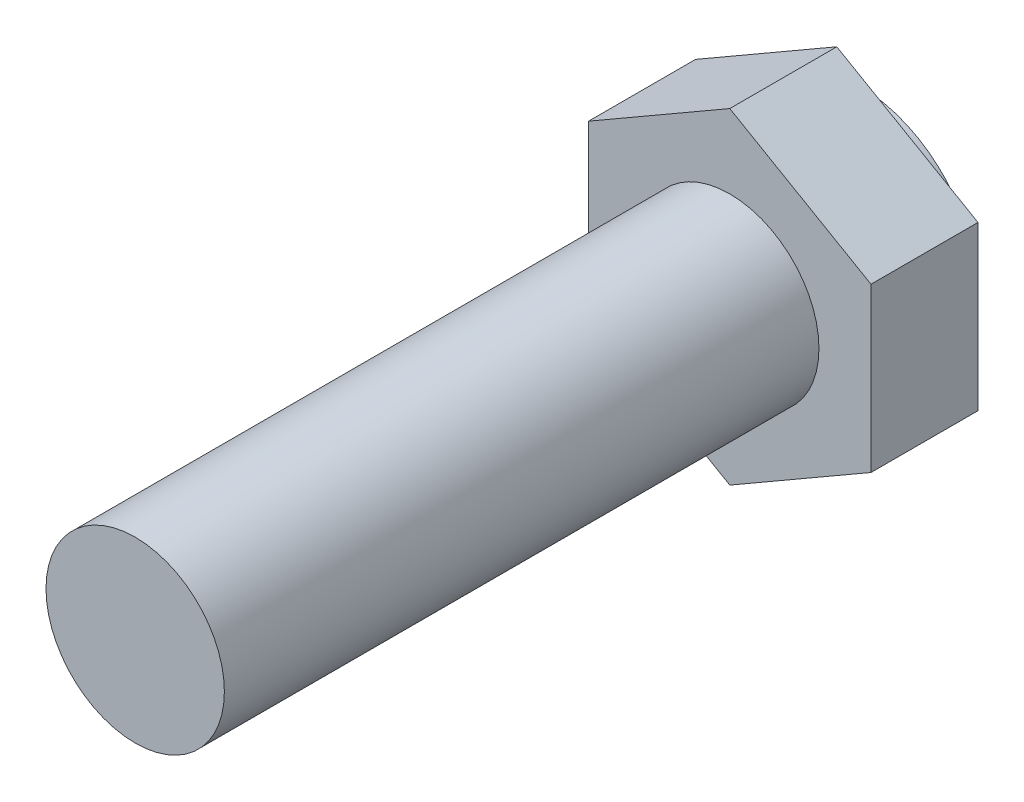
ISO-10303-21;
HEADER;
FILE_DESCRIPTION(('STEP AP214'),'2;1');
FILE_NAME('part.step','',(''),(''),'','','');
FILE_SCHEMA(('AUTOMOTIVE_DESIGN { 1 0 10303 214 1 1 1 1 }'));
ENDSEC;
DATA;
#1=APPLICATION_CONTEXT('core data for automotive mechanical design processes');
#2=APPLICATION_PROTOCOL_DEFINITION('international standard','automotive_design',2000,#1);
#3=PRODUCT_CONTEXT('',#1,'mechanical');
#4=PRODUCT('Part','Part','',(#3));
#5=PRODUCT_RELATED_PRODUCT_CATEGORY('part','',(#4));
#6=PRODUCT_DEFINITION_FORMATION('','',#4);
#7=PRODUCT_DEFINITION_CONTEXT('part definition',#1,'design');
#8=PRODUCT_DEFINITION('design','',#6,#7);
#9=PRODUCT_DEFINITION_SHAPE('','',#8);
#10=(LENGTH_UNIT() NAMED_UNIT(*) SI_UNIT(.MILLI.,.METRE.));
#11=(NAMED_UNIT(*) PLANE_ANGLE_UNIT() SI_UNIT($,.RADIAN.));
#12=(NAMED_UNIT(*) SI_UNIT($,.STERADIAN.) SOLID_ANGLE_UNIT());
#13=UNCERTAINTY_MEASURE_WITH_UNIT(LENGTH_MEASURE(1.E-05),#10,'distance_accuracy_value','');
#14=(GEOMETRIC_REPRESENTATION_CONTEXT(3) GLOBAL_UNCERTAINTY_ASSIGNED_CONTEXT((#13)) GLOBAL_UNIT_ASSIGNED_CONTEXT((#10,
#11,#12)) REPRESENTATION_CONTEXT('',''));
#15=CARTESIAN_POINT('',(0.,0.,0.));
#16=DIRECTION('',(0.,0.,1.));
#17=DIRECTION('',(1.,0.,0.));
#18=AXIS2_PLACEMENT_3D('',#15,#16,#17);
#19=CARTESIAN_POINT('',(0.,0.,48.7));
#20=DIRECTION('',(0.,0.,-1.));
#21=DIRECTION('',(-1.,0.,0.));
#22=AXIS2_PLACEMENT_3D('',#19,#20,#21);
#23=PLANE('',#22);
#24=CARTESIAN_POINT('',(0.,0.,48.7));
#25=DIRECTION('',(0.,0.,-1.));
#26=DIRECTION('',(-1.,0.,0.));
#27=AXIS2_PLACEMENT_3D('',#24,#25,#26);
#28=CIRCLE('',#27,6.);
#29=CARTESIAN_POINT('',(-6.,0.,48.7));
#30=VERTEX_POINT('',#29);
#31=EDGE_CURVE('E21',#30,#30,#28,.T.);
#32=ORIENTED_EDGE('',*,*,#31,.F.);
#33=EDGE_LOOP('',(#32));
#34=FACE_BOUND('',#33,.T.);
#35=ADVANCED_FACE('F14',(#34),#23,.F.);
#36=CARTESIAN_POINT('',(0.,0.,-21.3));
#37=DIRECTION('',(0.,0.,-1.));
#38=DIRECTION('',(-1.,0.,0.));
#39=AXIS2_PLACEMENT_3D('',#36,#37,#38);
#40=CYLINDRICAL_SURFACE('',#39,6.);
#41=CARTESIAN_POINT('',(0.,0.,8.7));
#42=DIRECTION('',(0.,0.,-1.));
#43=DIRECTION('',(-1.,0.,0.));
#44=AXIS2_PLACEMENT_3D('',#41,#42,#43);
#45=CIRCLE('',#44,6.);
#46=CARTESIAN_POINT('',(-6.,0.,8.7));
#47=VERTEX_POINT('',#46);
#48=EDGE_CURVE('E109',#47,#47,#45,.T.);
#49=ORIENTED_EDGE('',*,*,#48,.F.);
#50=EDGE_LOOP('',(#49));
#51=FACE_BOUND('',#50,.T.);
#52=ORIENTED_EDGE('',*,*,#31,.T.);
#53=EDGE_LOOP('',(#52));
#54=FACE_BOUND('',#53,.T.);
#55=ADVANCED_FACE('F153',(#51,#54),#40,.T.);
#56=CARTESIAN_POINT('',(-6.,0.,8.7));
#57=DIRECTION('',(0.,0.,-1.));
#58=DIRECTION('',(-1.,0.,0.));
#59=AXIS2_PLACEMENT_3D('',#56,#57,#58);
#60=PLANE('',#59);
#61=DIRECTION('',(0.866025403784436,-0.5,0.));
#62=VECTOR('',#61,1.);
#63=CARTESIAN_POINT('',(0.250000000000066,10.8253175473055,8.7));
#64=LINE('',#63,#62);
#65=CARTESIAN_POINT('',(0.,10.9696551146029,8.7));
#66=VERTEX_POINT('',#65);
#67=CARTESIAN_POINT('',(9.5,5.48482755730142,8.7));
#68=VERTEX_POINT('',#67);
#69=EDGE_CURVE('E80',#66,#68,#64,.T.);
#70=ORIENTED_EDGE('',*,*,#69,.F.);
#71=DIRECTION('',(-0.866025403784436,-0.5,0.));
#72=VECTOR('',#71,1.);
#73=CARTESIAN_POINT('',(-9.25,5.62916512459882,8.7));
#74=LINE('',#73,#72);
#75=CARTESIAN_POINT('',(-9.5,5.48482755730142,8.7));
#76=VERTEX_POINT('',#75);
#77=EDGE_CURVE('E106',#66,#76,#74,.T.);
#78=ORIENTED_EDGE('',*,*,#77,.T.);
#79=DIRECTION('',(0.,-1.,0.));
#80=VECTOR('',#79,1.);
#81=CARTESIAN_POINT('',(-9.5,0.,8.7));
#82=LINE('',#81,#80);
#83=CARTESIAN_POINT('',(-9.5,-5.48482755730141,8.7));
#84=VERTEX_POINT('',#83);
#85=EDGE_CURVE('E103',#76,#84,#82,.T.);
#86=ORIENTED_EDGE('',*,*,#85,.T.);
#87=DIRECTION('',(-0.866025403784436,0.5,0.));
#88=VECTOR('',#87,1.);
#89=CARTESIAN_POINT('',(-9.25,-5.62916512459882,8.7));
#90=LINE('',#89,#88);
#91=CARTESIAN_POINT('',(0.,-10.9696551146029,8.7));
#92=VERTEX_POINT('',#91);
#93=EDGE_CURVE('E101',#92,#84,#90,.T.);
#94=ORIENTED_EDGE('',*,*,#93,.F.);
#95=DIRECTION('',(0.866025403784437,0.5,0.));
#96=VECTOR('',#95,1.);
#97=CARTESIAN_POINT('',(0.250000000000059,-10.8253175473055,8.7));
#98=LINE('',#97,#96);
#99=CARTESIAN_POINT('',(9.5,-5.48482755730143,8.7));
#100=VERTEX_POINT('',#99);
#101=EDGE_CURVE('E98',#92,#100,#98,.T.);
#102=ORIENTED_EDGE('',*,*,#101,.T.);
#103=DIRECTION('',(0.,-1.,0.));
#104=VECTOR('',#103,1.);
#105=CARTESIAN_POINT('',(9.5,0.,8.7));
#106=LINE('',#105,#104);
#107=EDGE_CURVE('E96',#68,#100,#106,.T.);
#108=ORIENTED_EDGE('',*,*,#107,.F.);
#109=EDGE_LOOP('',(#70,#78,#86,#94,#102,#108));
#110=FACE_BOUND('',#109,.T.);
#111=ORIENTED_EDGE('',*,*,#48,.T.);
#112=EDGE_LOOP('',(#111));
#113=FACE_BOUND('',#112,.T.);
#114=ADVANCED_FACE('F135',(#110,#113),#60,.F.);
#115=CARTESIAN_POINT('',(0.,10.9696551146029,10.));
#116=DIRECTION('',(0.5,-0.866025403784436,0.));
#117=DIRECTION('',(-0.866025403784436,-0.5,0.));
#118=AXIS2_PLACEMENT_3D('',#115,#116,#117);
#119=PLANE('',#118);
#120=DIRECTION('',(0.,0.,-1.));
#121=VECTOR('',#120,1.);
#122=CARTESIAN_POINT('',(0.,10.9696551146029,10.));
#123=LINE('',#122,#121);
#124=CARTESIAN_POINT('',(0.,10.9696551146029,1.5));
#125=VERTEX_POINT('',#124);
#126=EDGE_CURVE('E34',#66,#125,#123,.T.);
#127=ORIENTED_EDGE('',*,*,#126,.T.);
#128=DIRECTION('',(-0.866025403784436,-0.5,0.));
#129=VECTOR('',#128,1.);
#130=CARTESIAN_POINT('',(0.,10.9696551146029,1.5));
#131=LINE('',#130,#129);
#132=CARTESIAN_POINT('',(-9.5,5.48482755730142,1.5));
#133=VERTEX_POINT('',#132);
#134=EDGE_CURVE('E27',#125,#133,#131,.T.);
#135=ORIENTED_EDGE('',*,*,#134,.T.);
#136=DIRECTION('',(0.,0.,-1.));
#137=VECTOR('',#136,1.);
#138=CARTESIAN_POINT('',(-9.5,5.48482755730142,10.));
#139=LINE('',#138,#137);
#140=EDGE_CURVE('E92',#76,#133,#139,.T.);
#141=ORIENTED_EDGE('',*,*,#140,.F.);
#142=ORIENTED_EDGE('',*,*,#77,.F.);
#143=EDGE_LOOP('',(#127,#135,#141,#142));
#144=FACE_BOUND('',#143,.T.);
#145=ADVANCED_FACE('F129',(#144),#119,.F.);
#146=CARTESIAN_POINT('',(-9.5,5.48482755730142,10.));
#147=DIRECTION('',(1.,0.,0.));
#148=DIRECTION('',(0.,0.,-1.));
#149=AXIS2_PLACEMENT_3D('',#146,#147,#148);
#150=PLANE('',#149);
#151=ORIENTED_EDGE('',*,*,#140,.T.);
#152=DIRECTION('',(0.,-1.,0.));
#153=VECTOR('',#152,1.);
#154=CARTESIAN_POINT('',(-9.5,5.48482755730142,1.5));
#155=LINE('',#154,#153);
#156=CARTESIAN_POINT('',(-9.5,-5.48482755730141,1.5));
#157=VERTEX_POINT('',#156);
#158=EDGE_CURVE('E125',#133,#157,#155,.T.);
#159=ORIENTED_EDGE('',*,*,#158,.T.);
#160=DIRECTION('',(0.,0.,-1.));
#161=VECTOR('',#160,1.);
#162=CARTESIAN_POINT('',(-9.5,-5.48482755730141,10.));
#163=LINE('',#162,#161);
#164=EDGE_CURVE('E89',#84,#157,#163,.T.);
#165=ORIENTED_EDGE('',*,*,#164,.F.);
#166=ORIENTED_EDGE('',*,*,#85,.F.);
#167=EDGE_LOOP('',(#151,#159,#165,#166));
#168=FACE_BOUND('',#167,.T.);
#169=ADVANCED_FACE('F131',(#168),#150,.F.);
#170=CARTESIAN_POINT('',(0.,-10.9696551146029,10.));
#171=DIRECTION('',(-0.5,-0.866025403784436,0.));
#172=DIRECTION('',(-0.866025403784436,0.5,0.));
#173=AXIS2_PLACEMENT_3D('',#170,#171,#172);
#174=PLANE('',#173);
#175=DIRECTION('',(-0.866025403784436,0.5,0.));
#176=VECTOR('',#175,1.);
#177=CARTESIAN_POINT('',(0.,-10.9696551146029,1.5));
#178=LINE('',#177,#176);
#179=CARTESIAN_POINT('',(0.,-10.9696551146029,1.5));
#180=VERTEX_POINT('',#179);
#181=EDGE_CURVE('E123',#180,#157,#178,.T.);
#182=ORIENTED_EDGE('',*,*,#181,.F.);
#183=DIRECTION('',(0.,0.,-1.));
#184=VECTOR('',#183,1.);
#185=CARTESIAN_POINT('',(0.,-10.9696551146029,10.));
#186=LINE('',#185,#184);
#187=EDGE_CURVE('E82',#92,#180,#186,.T.);
#188=ORIENTED_EDGE('',*,*,#187,.F.);
#189=ORIENTED_EDGE('',*,*,#93,.T.);
#190=ORIENTED_EDGE('',*,*,#164,.T.);
#191=EDGE_LOOP('',(#182,#188,#189,#190));
#192=FACE_BOUND('',#191,.T.);
#193=ADVANCED_FACE('F142',(#192),#174,.T.);
#194=CARTESIAN_POINT('',(0.,-10.9696551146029,10.));
#195=DIRECTION('',(-0.5,0.866025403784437,0.));
#196=DIRECTION('',(0.866025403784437,0.5,0.));
#197=AXIS2_PLACEMENT_3D('',#194,#195,#196);
#198=PLANE('',#197);
#199=ORIENTED_EDGE('',*,*,#187,.T.);
#200=DIRECTION('',(0.866025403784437,0.5,0.));
#201=VECTOR('',#200,1.);
#202=CARTESIAN_POINT('',(0.,-10.9696551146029,1.5));
#203=LINE('',#202,#201);
#204=CARTESIAN_POINT('',(9.5,-5.48482755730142,1.5));
#205=VERTEX_POINT('',#204);
#206=EDGE_CURVE('E75',#180,#205,#203,.T.);
#207=ORIENTED_EDGE('',*,*,#206,.T.);
#208=DIRECTION('',(0.,0.,-1.));
#209=VECTOR('',#208,1.);
#210=CARTESIAN_POINT('',(9.5,-5.48482755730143,10.));
#211=LINE('',#210,#209);
#212=EDGE_CURVE('E74',#100,#205,#211,.T.);
#213=ORIENTED_EDGE('',*,*,#212,.F.);
#214=ORIENTED_EDGE('',*,*,#101,.F.);
#215=EDGE_LOOP('',(#199,#207,#213,#214));
#216=FACE_BOUND('',#215,.T.);
#217=ADVANCED_FACE('F138',(#216),#198,.F.);
#218=CARTESIAN_POINT('',(9.5,5.48482755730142,10.));
#219=DIRECTION('',(1.,0.,0.));
#220=DIRECTION('',(0.,-1.,0.));
#221=AXIS2_PLACEMENT_3D('',#218,#219,#220);
#222=PLANE('',#221);
#223=DIRECTION('',(0.,-1.,0.));
#224=VECTOR('',#223,1.);
#225=CARTESIAN_POINT('',(9.5,5.48482755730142,1.5));
#226=LINE('',#225,#224);
#227=CARTESIAN_POINT('',(9.5,5.48482755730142,1.5));
#228=VERTEX_POINT('',#227);
#229=EDGE_CURVE('E64',#228,#205,#226,.T.);
#230=ORIENTED_EDGE('',*,*,#229,.F.);
#231=DIRECTION('',(0.,0.,-1.));
#232=VECTOR('',#231,1.);
#233=CARTESIAN_POINT('',(9.5,5.48482755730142,10.));
#234=LINE('',#233,#232);
#235=EDGE_CURVE('E71',#68,#228,#234,.T.);
#236=ORIENTED_EDGE('',*,*,#235,.F.);
#237=ORIENTED_EDGE('',*,*,#107,.T.);
#238=ORIENTED_EDGE('',*,*,#212,.T.);
#239=EDGE_LOOP('',(#230,#236,#237,#238));
#240=FACE_BOUND('',#239,.T.);
#241=ADVANCED_FACE('F70',(#240),#222,.T.);
#242=CARTESIAN_POINT('',(0.,10.9696551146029,10.));
#243=DIRECTION('',(0.5,0.866025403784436,0.));
#244=DIRECTION('',(0.866025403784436,-0.5,0.));
#245=AXIS2_PLACEMENT_3D('',#242,#243,#244);
#246=PLANE('',#245);
#247=DIRECTION('',(0.866025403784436,-0.5,0.));
#248=VECTOR('',#247,1.);
#249=CARTESIAN_POINT('',(0.,10.9696551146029,1.5));
#250=LINE('',#249,#248);
#251=EDGE_CURVE('E9',#125,#228,#250,.T.);
#252=ORIENTED_EDGE('',*,*,#251,.F.);
#253=ORIENTED_EDGE('',*,*,#126,.F.);
#254=ORIENTED_EDGE('',*,*,#69,.T.);
#255=ORIENTED_EDGE('',*,*,#235,.T.);
#256=EDGE_LOOP('',(#252,#253,#254,#255));
#257=FACE_BOUND('',#256,.T.);
#258=ADVANCED_FACE('F78',(#257),#246,.T.);
#259=CARTESIAN_POINT('',(0.,14.4999999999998,1.5));
#260=DIRECTION('',(0.,0.,1.));
#261=DIRECTION('',(1.,0.,0.));
#262=AXIS2_PLACEMENT_3D('',#259,#260,#261);
#263=PLANE('',#262);
#264=CARTESIAN_POINT('',(0.,0.,1.5));
#265=DIRECTION('',(0.,0.,-1.));
#266=DIRECTION('',(-1.,0.,0.));
#267=AXIS2_PLACEMENT_3D('',#264,#265,#266);
#268=CIRCLE('',#267,7.95);
#269=CARTESIAN_POINT('',(-7.95,0.,1.5));
#270=VERTEX_POINT('',#269);
#271=EDGE_CURVE('E114',#270,#270,#268,.T.);
#272=ORIENTED_EDGE('',*,*,#271,.F.);
#273=EDGE_LOOP('',(#272));
#274=FACE_BOUND('',#273,.T.);
#275=ORIENTED_EDGE('',*,*,#251,.T.);
#276=ORIENTED_EDGE('',*,*,#229,.T.);
#277=ORIENTED_EDGE('',*,*,#206,.F.);
#278=ORIENTED_EDGE('',*,*,#181,.T.);
#279=ORIENTED_EDGE('',*,*,#158,.F.);
#280=ORIENTED_EDGE('',*,*,#134,.F.);
#281=EDGE_LOOP('',(#275,#276,#277,#278,#279,#280));
#282=FACE_BOUND('',#281,.T.);
#283=ADVANCED_FACE('F63',(#274,#282),#263,.F.);
#284=CARTESIAN_POINT('',(0.,0.,8.7));
#285=DIRECTION('',(0.,0.,-1.));
#286=DIRECTION('',(-1.,0.,0.));
#287=AXIS2_PLACEMENT_3D('',#284,#285,#286);
#288=CYLINDRICAL_SURFACE('',#287,7.95);
#289=ORIENTED_EDGE('',*,*,#271,.T.);
#290=EDGE_LOOP('',(#289));
#291=FACE_BOUND('',#290,.T.);
#292=CARTESIAN_POINT('',(0.,0.,0.));
#293=DIRECTION('',(0.,0.,1.));
#294=DIRECTION('',(1.,0.,0.));
#295=AXIS2_PLACEMENT_3D('',#292,#293,#294);
#296=CIRCLE('',#295,7.95);
#297=CARTESIAN_POINT('',(7.95,0.,0.));
#298=VERTEX_POINT('',#297);
#299=EDGE_CURVE('E76',#298,#298,#296,.T.);
#300=ORIENTED_EDGE('',*,*,#299,.T.);
#301=EDGE_LOOP('',(#300));
#302=FACE_BOUND('',#301,.T.);
#303=ADVANCED_FACE('F169',(#291,#302),#288,.T.);
#304=CARTESIAN_POINT('',(-11.,0.,0.));
#305=DIRECTION('',(0.,0.,1.));
#306=DIRECTION('',(1.,0.,0.));
#307=AXIS2_PLACEMENT_3D('',#304,#305,#306);
#308=PLANE('',#307);
#309=ORIENTED_EDGE('',*,*,#299,.F.);
#310=EDGE_LOOP('',(#309));
#311=FACE_BOUND('',#310,.T.);
#312=ADVANCED_FACE('F167',(#311),#308,.F.);
#313=CLOSED_SHELL('',(#35,#55,#114,#145,#169,#193,#217,#241,#258,#283,#303,#312));
#314=MANIFOLD_SOLID_BREP('B1',#313);
#315=ADVANCED_BREP_SHAPE_REPRESENTATION('',(#18,#314),#14);
#316=SHAPE_DEFINITION_REPRESENTATION(#9,#315);
ENDSEC;
END-ISO-10303-21;
